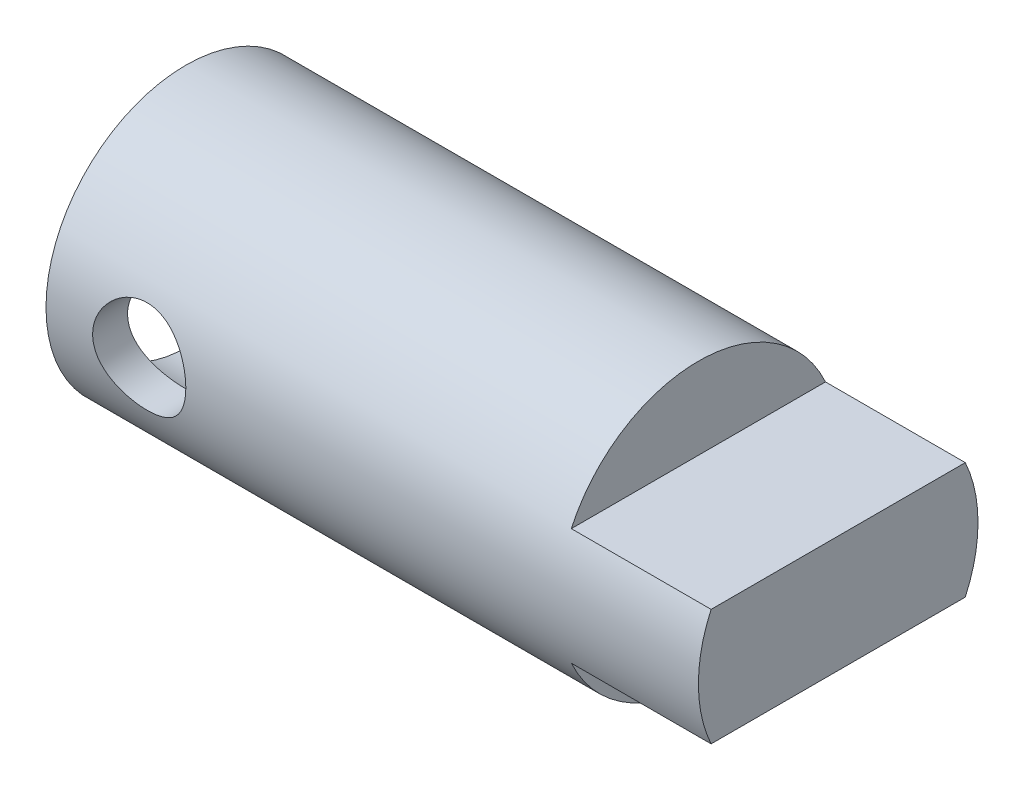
ISO-10303-21;
HEADER;
FILE_DESCRIPTION(('STEP AP214'),'2;1');
FILE_NAME('part.step','',(''),(''),'','','');
FILE_SCHEMA(('AUTOMOTIVE_DESIGN { 1 0 10303 214 1 1 1 1 }'));
ENDSEC;
DATA;
#1=APPLICATION_CONTEXT('core data for automotive mechanical design processes');
#2=APPLICATION_PROTOCOL_DEFINITION('international standard','automotive_design',2000,#1);
#3=PRODUCT_CONTEXT('',#1,'mechanical');
#4=PRODUCT('Part','Part','',(#3));
#5=PRODUCT_RELATED_PRODUCT_CATEGORY('part','',(#4));
#6=PRODUCT_DEFINITION_FORMATION('','',#4);
#7=PRODUCT_DEFINITION_CONTEXT('part definition',#1,'design');
#8=PRODUCT_DEFINITION('design','',#6,#7);
#9=PRODUCT_DEFINITION_SHAPE('','',#8);
#10=(LENGTH_UNIT() NAMED_UNIT(*) SI_UNIT(.MILLI.,.METRE.));
#11=(NAMED_UNIT(*) PLANE_ANGLE_UNIT() SI_UNIT($,.RADIAN.));
#12=(NAMED_UNIT(*) SI_UNIT($,.STERADIAN.) SOLID_ANGLE_UNIT());
#13=UNCERTAINTY_MEASURE_WITH_UNIT(LENGTH_MEASURE(1.E-05),#10,'distance_accuracy_value','');
#14=(GEOMETRIC_REPRESENTATION_CONTEXT(3) GLOBAL_UNCERTAINTY_ASSIGNED_CONTEXT((#13)) GLOBAL_UNIT_ASSIGNED_CONTEXT((#10,
#11,#12)) REPRESENTATION_CONTEXT('',''));
#15=CARTESIAN_POINT('',(0.,0.,0.));
#16=DIRECTION('',(0.,0.,1.));
#17=DIRECTION('',(1.,0.,0.));
#18=AXIS2_PLACEMENT_3D('',#15,#16,#17);
#19=CARTESIAN_POINT('',(0.,0.,0.));
#20=DIRECTION('',(-1.,0.,0.));
#21=DIRECTION('',(0.,0.,1.));
#22=AXIS2_PLACEMENT_3D('',#19,#20,#21);
#23=CONICAL_SURFACE('',#22,4.5,1.22689824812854);
#24=CARTESIAN_POINT('',(1.6115796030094,0.,0.));
#25=VERTEX_POINT('',#24);
#26=VERTEX_LOOP('',#25);
#27=FACE_BOUND('',#26,.T.);
#28=CARTESIAN_POINT('',(0.,0.,0.));
#29=DIRECTION('',(-1.,0.,0.));
#30=DIRECTION('',(0.,0.,1.));
#31=AXIS2_PLACEMENT_3D('',#28,#29,#30);
#32=CIRCLE('',#31,4.5);
#33=CARTESIAN_POINT('',(0.,0.,4.5));
#34=VERTEX_POINT('',#33);
#35=EDGE_CURVE('E112',#34,#34,#32,.T.);
#36=ORIENTED_EDGE('',*,*,#35,.T.);
#37=EDGE_LOOP('',(#36));
#38=FACE_BOUND('',#37,.T.);
#39=ADVANCED_FACE('F33',(#27,#38),#23,.F.);
#40=CARTESIAN_POINT('',(-58.2554655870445,0.,0.));
#41=DIRECTION('',(-1.,0.,0.));
#42=DIRECTION('',(0.,0.,1.));
#43=AXIS2_PLACEMENT_3D('',#40,#41,#42);
#44=CYLINDRICAL_SURFACE('',#43,4.5);
#45=CARTESIAN_POINT('',(-7.99999999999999,0.,4.5));
#46=CARTESIAN_POINT('',(-8.00000498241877,0.106491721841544,4.49999592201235));
#47=CARTESIAN_POINT('',(-8.0085554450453,0.21314990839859,4.49617759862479));
#48=CARTESIAN_POINT('',(-8.04241844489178,0.423397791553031,4.48128347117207));
#49=CARTESIAN_POINT('',(-8.06777125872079,0.526979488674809,4.4701902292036));
#50=CARTESIAN_POINT('',(-8.13410046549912,0.727700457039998,4.44192390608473));
#51=CARTESIAN_POINT('',(-8.17502111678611,0.824861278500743,4.4247725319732));
#52=CARTESIAN_POINT('',(-8.27107528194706,1.01083182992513,4.38602940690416));
#53=CARTESIAN_POINT('',(-8.32620555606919,1.09964345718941,4.36443866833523));
#54=CARTESIAN_POINT('',(-8.45233484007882,1.27147987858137,4.31759990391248));
#55=CARTESIAN_POINT('',(-8.52399764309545,1.35398160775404,4.29222181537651));
#56=CARTESIAN_POINT('',(-8.67974826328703,1.50625667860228,4.24118529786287));
#57=CARTESIAN_POINT('',(-8.76384343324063,1.57602243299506,4.21552671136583));
#58=CARTESIAN_POINT('',(-8.94793872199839,1.70484606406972,4.16516047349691));
#59=CARTESIAN_POINT('',(-9.04857681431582,1.76305311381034,4.14059326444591));
#60=CARTESIAN_POINT('',(-9.25945524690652,1.86148058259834,4.09729211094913));
#61=CARTESIAN_POINT('',(-9.3696899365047,1.90171150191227,4.07855476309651));
#62=CARTESIAN_POINT('',(-9.59062038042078,1.96081152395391,4.05046224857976));
#63=CARTESIAN_POINT('',(-9.70098673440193,1.98069316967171,4.04066532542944));
#64=CARTESIAN_POINT('',(-9.92388977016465,2.00167828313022,4.03031463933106));
#65=CARTESIAN_POINT('',(-10.0364249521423,2.00279429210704,4.02975470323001));
#66=CARTESIAN_POINT('',(-10.2496954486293,1.98697164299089,4.03757276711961));
#67=CARTESIAN_POINT('',(-10.3505853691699,1.97164003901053,4.04515525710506));
#68=CARTESIAN_POINT('',(-10.5481752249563,1.92608101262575,4.06704362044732));
#69=CARTESIAN_POINT('',(-10.6448742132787,1.89585024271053,4.08135100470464));
#70=CARTESIAN_POINT('',(-10.8339336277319,1.82075207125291,4.11540857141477));
#71=CARTESIAN_POINT('',(-10.9261479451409,1.77557135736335,4.13527371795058));
#72=CARTESIAN_POINT('',(-11.1020759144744,1.67208117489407,4.1781907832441));
#73=CARTESIAN_POINT('',(-11.1857859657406,1.61376617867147,4.20124404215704));
#74=CARTESIAN_POINT('',(-11.3509136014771,1.47900808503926,4.25066638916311));
#75=CARTESIAN_POINT('',(-11.4313134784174,1.40135242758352,4.2771397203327));
#76=CARTESIAN_POINT('',(-11.5783174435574,1.23343821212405,4.32854899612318));
#77=CARTESIAN_POINT('',(-11.6449173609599,1.14317585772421,4.3534844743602));
#78=CARTESIAN_POINT('',(-11.764213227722,0.949152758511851,4.39992448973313));
#79=CARTESIAN_POINT('',(-11.8164403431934,0.845072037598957,4.42130591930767));
#80=CARTESIAN_POINT('',(-11.9022769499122,0.628407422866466,4.45725580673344));
#81=CARTESIAN_POINT('',(-11.935898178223,0.515828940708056,4.47182855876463));
#82=CARTESIAN_POINT('',(-11.981311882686,0.293820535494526,4.4916825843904));
#83=CARTESIAN_POINT('',(-11.994466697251,0.184721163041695,4.49754246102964));
#84=CARTESIAN_POINT('',(-12.0027031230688,-0.0342770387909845,4.5012000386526));
#85=CARTESIAN_POINT('',(-11.997790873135,-0.144175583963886,4.49900047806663));
#86=CARTESIAN_POINT('',(-11.9709564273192,-0.354907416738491,4.48715295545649));
#87=CARTESIAN_POINT('',(-11.9500391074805,-0.455896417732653,4.47794517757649));
#88=CARTESIAN_POINT('',(-11.8932420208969,-0.652792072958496,4.45350542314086));
#89=CARTESIAN_POINT('',(-11.8573604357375,-0.748698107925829,4.43827271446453));
#90=CARTESIAN_POINT('',(-11.7705111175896,-0.936104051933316,4.40262377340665));
#91=CARTESIAN_POINT('',(-11.7191076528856,-1.02737315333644,4.38206065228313));
#92=CARTESIAN_POINT('',(-11.6031485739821,-1.20031927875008,4.33788123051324));
#93=CARTESIAN_POINT('',(-11.5385872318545,-1.28199210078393,4.31426360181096));
#94=CARTESIAN_POINT('',(-11.3920832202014,-1.44036721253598,4.26412793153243));
#95=CARTESIAN_POINT('',(-11.3091590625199,-1.5161383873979,4.23752954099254));
#96=CARTESIAN_POINT('',(-11.1314446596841,-1.65300242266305,4.18604134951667));
#97=CARTESIAN_POINT('',(-11.0366502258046,-1.71409007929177,4.16115215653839));
#98=CARTESIAN_POINT('',(-10.8348756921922,-1.8210757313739,4.11547790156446));
#99=CARTESIAN_POINT('',(-10.7276616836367,-1.86658327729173,4.09480296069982));
#100=CARTESIAN_POINT('',(-10.5058731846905,-1.9384649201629,4.06127502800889));
#101=CARTESIAN_POINT('',(-10.3913060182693,-1.96485774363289,4.04841438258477));
#102=CARTESIAN_POINT('',(-10.1685184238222,-1.99578547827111,4.03325053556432));
#103=CARTESIAN_POINT('',(-10.0605831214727,-2.00198344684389,4.03014488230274));
#104=CARTESIAN_POINT('',(-9.84524039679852,-1.99690774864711,4.03266289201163));
#105=CARTESIAN_POINT('',(-9.73783286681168,-1.9856378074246,4.03828469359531));
#106=CARTESIAN_POINT('',(-9.53330807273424,-1.94740226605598,4.056849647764));
#107=CARTESIAN_POINT('',(-9.43596048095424,-1.92142172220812,4.06933199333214));
#108=CARTESIAN_POINT('',(-9.24701808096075,-1.85554194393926,4.09978946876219));
#109=CARTESIAN_POINT('',(-9.15542494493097,-1.81563868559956,4.11776618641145));
#110=CARTESIAN_POINT('',(-8.97416239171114,-1.72012109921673,4.15861055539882));
#111=CARTESIAN_POINT('',(-8.88499235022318,-1.66366385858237,4.18171780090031));
#112=CARTESIAN_POINT('',(-8.71687518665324,-1.53773594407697,4.22964589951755));
#113=CARTESIAN_POINT('',(-8.63793235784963,-1.46825983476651,4.25446746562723));
#114=CARTESIAN_POINT('',(-8.4853775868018,-1.31108140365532,4.30563232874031));
#115=CARTESIAN_POINT('',(-8.41283603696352,-1.22231636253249,4.33191880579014));
#116=CARTESIAN_POINT('',(-8.28356478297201,-1.03295134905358,4.38093190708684));
#117=CARTESIAN_POINT('',(-8.22684230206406,-0.932345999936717,4.40365690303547));
#118=CARTESIAN_POINT('',(-8.13177613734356,-0.723051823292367,4.44279207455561));
#119=CARTESIAN_POINT('',(-8.09323188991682,-0.614467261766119,4.45927074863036));
#120=CARTESIAN_POINT('',(-8.03536024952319,-0.391615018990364,4.48431907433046));
#121=CARTESIAN_POINT('',(-8.01597423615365,-0.27736580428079,4.49291284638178));
#122=CARTESIAN_POINT('',(-8.0044002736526,-0.135356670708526,4.49804618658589));
#123=CARTESIAN_POINT('',(-8.00275171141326,-0.108319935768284,4.49877760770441));
#124=CARTESIAN_POINT('',(-8.00055093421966,-0.0541923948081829,4.49975503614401));
#125=CARTESIAN_POINT('',(-7.99999873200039,-0.0271015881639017,4.5000010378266));
#126=CARTESIAN_POINT('',(-7.99999999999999,0.,4.5));
#127=B_SPLINE_CURVE_WITH_KNOTS('',3,(#45,#46,#47,#48,#49,#50,#51,#52,#53,#54,#55,#56,#57,#58,
#59,#60,#61,#62,#63,#64,#65,#66,#67,#68,#69,#70,#71,#72,#73,#74,#75,#76,#77,#78,#79,#80,#81,#82,
#83,#84,#85,#86,#87,#88,#89,#90,#91,#92,#93,#94,#95,#96,#97,#98,#99,#100,#101,#102,#103,#104,
#105,#106,#107,#108,#109,#110,#111,#112,#113,#114,#115,#116,#117,#118,#119,#120,#121,#122,#123,
#124,#125,#126),.UNSPECIFIED.,.T.,.F.,(4,2,2,2,2,2,2,2,2,2,2,2,2,2,2,2,2,2,2,2,2,2,2,2,2,2,2,2,
2,2,2,2,2,2,2,2,2,2,2,2,4),(0.,0.319363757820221,0.639495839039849,0.958492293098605,
1.27741608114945,1.61253910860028,1.9478611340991,2.30254396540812,2.65701934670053,
2.99284475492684,3.32844571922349,3.63400850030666,3.93963996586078,4.25213185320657,
4.56475550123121,4.90783346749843,5.25101497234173,5.6043339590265,5.95742980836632,
6.28582812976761,6.61411487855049,6.92332786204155,7.23257843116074,7.5514769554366,
7.87051460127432,8.2152651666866,8.56013773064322,8.91311015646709,9.26573630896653,
9.58847399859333,9.91114286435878,10.214399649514,10.5177441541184,10.8405269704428,
11.1634448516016,11.5146101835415,11.8659356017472,12.2132884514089,12.5595751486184,
12.6408506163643,12.7221270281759),.UNSPECIFIED.);
#128=CARTESIAN_POINT('',(-7.99999999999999,0.,4.5));
#129=VERTEX_POINT('',#128);
#130=EDGE_CURVE('E88',#129,#129,#127,.T.);
#131=ORIENTED_EDGE('',*,*,#130,.T.);
#132=EDGE_LOOP('',(#131));
#133=FACE_BOUND('',#132,.T.);
#134=CARTESIAN_POINT('',(-8.,0.,-4.5));
#135=CARTESIAN_POINT('',(-8.00000498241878,-0.106491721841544,-4.49999592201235));
#136=CARTESIAN_POINT('',(-8.0085554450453,-0.213149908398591,-4.49617759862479));
#137=CARTESIAN_POINT('',(-8.04241844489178,-0.423397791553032,-4.48128347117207));
#138=CARTESIAN_POINT('',(-8.06777125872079,-0.52697948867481,-4.4701902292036));
#139=CARTESIAN_POINT('',(-8.13410046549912,-0.727700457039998,-4.44192390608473));
#140=CARTESIAN_POINT('',(-8.17502111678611,-0.824861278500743,-4.4247725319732));
#141=CARTESIAN_POINT('',(-8.27107528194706,-1.01083182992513,-4.38602940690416));
#142=CARTESIAN_POINT('',(-8.32620555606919,-1.09964345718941,-4.36443866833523));
#143=CARTESIAN_POINT('',(-8.45233484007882,-1.27147987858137,-4.31759990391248));
#144=CARTESIAN_POINT('',(-8.52399764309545,-1.35398160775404,-4.29222181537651));
#145=CARTESIAN_POINT('',(-8.67974826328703,-1.50625667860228,-4.24118529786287));
#146=CARTESIAN_POINT('',(-8.76384343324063,-1.57602243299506,-4.21552671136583));
#147=CARTESIAN_POINT('',(-8.94793872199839,-1.70484606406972,-4.16516047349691));
#148=CARTESIAN_POINT('',(-9.04857681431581,-1.76305311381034,-4.14059326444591));
#149=CARTESIAN_POINT('',(-9.25945524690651,-1.86148058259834,-4.09729211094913));
#150=CARTESIAN_POINT('',(-9.3696899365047,-1.90171150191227,-4.07855476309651));
#151=CARTESIAN_POINT('',(-9.59062038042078,-1.96081152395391,-4.05046224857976));
#152=CARTESIAN_POINT('',(-9.70098673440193,-1.98069316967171,-4.04066532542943));
#153=CARTESIAN_POINT('',(-9.92388977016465,-2.00167828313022,-4.03031463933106));
#154=CARTESIAN_POINT('',(-10.0364249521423,-2.00279429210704,-4.02975470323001));
#155=CARTESIAN_POINT('',(-10.2496954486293,-1.98697164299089,-4.03757276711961));
#156=CARTESIAN_POINT('',(-10.3505853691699,-1.97164003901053,-4.04515525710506));
#157=CARTESIAN_POINT('',(-10.5481752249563,-1.92608101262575,-4.06704362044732));
#158=CARTESIAN_POINT('',(-10.6448742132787,-1.89585024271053,-4.08135100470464));
#159=CARTESIAN_POINT('',(-10.8339336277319,-1.82075207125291,-4.11540857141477));
#160=CARTESIAN_POINT('',(-10.9261479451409,-1.77557135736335,-4.13527371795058));
#161=CARTESIAN_POINT('',(-11.1020759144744,-1.67208117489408,-4.1781907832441));
#162=CARTESIAN_POINT('',(-11.1857859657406,-1.61376617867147,-4.20124404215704));
#163=CARTESIAN_POINT('',(-11.3509136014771,-1.47900808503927,-4.25066638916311));
#164=CARTESIAN_POINT('',(-11.4313134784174,-1.40135242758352,-4.2771397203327));
#165=CARTESIAN_POINT('',(-11.5783174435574,-1.23343821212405,-4.32854899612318));
#166=CARTESIAN_POINT('',(-11.6449173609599,-1.14317585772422,-4.3534844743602));
#167=CARTESIAN_POINT('',(-11.764213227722,-0.949152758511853,-4.39992448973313));
#168=CARTESIAN_POINT('',(-11.8164403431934,-0.845072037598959,-4.42130591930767));
#169=CARTESIAN_POINT('',(-11.9022769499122,-0.628407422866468,-4.45725580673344));
#170=CARTESIAN_POINT('',(-11.935898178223,-0.515828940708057,-4.47182855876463));
#171=CARTESIAN_POINT('',(-11.981311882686,-0.293820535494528,-4.4916825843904));
#172=CARTESIAN_POINT('',(-11.994466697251,-0.184721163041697,-4.49754246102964));
#173=CARTESIAN_POINT('',(-12.0027031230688,0.0342770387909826,-4.5012000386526));
#174=CARTESIAN_POINT('',(-11.997790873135,0.144175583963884,-4.49900047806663));
#175=CARTESIAN_POINT('',(-11.9709564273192,0.354907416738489,-4.48715295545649));
#176=CARTESIAN_POINT('',(-11.9500391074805,0.45589641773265,-4.47794517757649));
#177=CARTESIAN_POINT('',(-11.8932420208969,0.652792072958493,-4.45350542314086));
#178=CARTESIAN_POINT('',(-11.8573604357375,0.748698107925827,-4.43827271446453));
#179=CARTESIAN_POINT('',(-11.7705111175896,0.936104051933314,-4.40262377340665));
#180=CARTESIAN_POINT('',(-11.7191076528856,1.02737315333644,-4.38206065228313));
#181=CARTESIAN_POINT('',(-11.6031485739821,1.20031927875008,-4.33788123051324));
#182=CARTESIAN_POINT('',(-11.5385872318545,1.28199210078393,-4.31426360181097));
#183=CARTESIAN_POINT('',(-11.3920832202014,1.44036721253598,-4.26412793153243));
#184=CARTESIAN_POINT('',(-11.3091590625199,1.5161383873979,-4.23752954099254));
#185=CARTESIAN_POINT('',(-11.1314446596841,1.65300242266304,-4.18604134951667));
#186=CARTESIAN_POINT('',(-11.0366502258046,1.71409007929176,-4.16115215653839));
#187=CARTESIAN_POINT('',(-10.8348756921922,1.8210757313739,-4.11547790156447));
#188=CARTESIAN_POINT('',(-10.7276616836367,1.86658327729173,-4.09480296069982));
#189=CARTESIAN_POINT('',(-10.5058731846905,1.9384649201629,-4.06127502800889));
#190=CARTESIAN_POINT('',(-10.3913060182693,1.96485774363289,-4.04841438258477));
#191=CARTESIAN_POINT('',(-10.1685184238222,1.9957854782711,-4.03325053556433));
#192=CARTESIAN_POINT('',(-10.0605831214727,2.00198344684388,-4.03014488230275));
#193=CARTESIAN_POINT('',(-9.84524039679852,1.99690774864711,-4.03266289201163));
#194=CARTESIAN_POINT('',(-9.73783286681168,1.9856378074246,-4.03828469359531));
#195=CARTESIAN_POINT('',(-9.53330807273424,1.94740226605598,-4.056849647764));
#196=CARTESIAN_POINT('',(-9.43596048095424,1.92142172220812,-4.06933199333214));
#197=CARTESIAN_POINT('',(-9.24701808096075,1.85554194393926,-4.09978946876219));
#198=CARTESIAN_POINT('',(-9.15542494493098,1.81563868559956,-4.11776618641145));
#199=CARTESIAN_POINT('',(-8.97416239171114,1.72012109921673,-4.15861055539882));
#200=CARTESIAN_POINT('',(-8.88499235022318,1.66366385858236,-4.18171780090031));
#201=CARTESIAN_POINT('',(-8.71687518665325,1.53773594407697,-4.22964589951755));
#202=CARTESIAN_POINT('',(-8.63793235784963,1.4682598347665,-4.25446746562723));
#203=CARTESIAN_POINT('',(-8.4853775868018,1.31108140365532,-4.30563232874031));
#204=CARTESIAN_POINT('',(-8.41283603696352,1.22231636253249,-4.33191880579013));
#205=CARTESIAN_POINT('',(-8.28356478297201,1.03295134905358,-4.38093190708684));
#206=CARTESIAN_POINT('',(-8.22684230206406,0.932345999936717,-4.40365690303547));
#207=CARTESIAN_POINT('',(-8.13177613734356,0.723051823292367,-4.44279207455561));
#208=CARTESIAN_POINT('',(-8.09323188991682,0.614467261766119,-4.45927074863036));
#209=CARTESIAN_POINT('',(-8.03536024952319,0.391615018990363,-4.48431907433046));
#210=CARTESIAN_POINT('',(-8.01597423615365,0.277365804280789,-4.49291284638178));
#211=CARTESIAN_POINT('',(-8.0044002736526,0.135356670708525,-4.49804618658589));
#212=CARTESIAN_POINT('',(-8.00275171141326,0.108319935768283,-4.49877760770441));
#213=CARTESIAN_POINT('',(-8.00055093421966,0.0541923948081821,-4.49975503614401));
#214=CARTESIAN_POINT('',(-7.99999873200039,0.0271015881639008,-4.5000010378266));
#215=CARTESIAN_POINT('',(-8.,0.,-4.5));
#216=B_SPLINE_CURVE_WITH_KNOTS('',3,(#134,#135,#136,#137,#138,#139,#140,#141,#142,#143,#144,
#145,#146,#147,#148,#149,#150,#151,#152,#153,#154,#155,#156,#157,#158,#159,#160,#161,#162,#163,
#164,#165,#166,#167,#168,#169,#170,#171,#172,#173,#174,#175,#176,#177,#178,#179,#180,#181,#182,
#183,#184,#185,#186,#187,#188,#189,#190,#191,#192,#193,#194,#195,#196,#197,#198,#199,#200,#201,
#202,#203,#204,#205,#206,#207,#208,#209,#210,#211,#212,#213,#214,#215),.UNSPECIFIED.,.T.,.F.,(4,
2,2,2,2,2,2,2,2,2,2,2,2,2,2,2,2,2,2,2,2,2,2,2,2,2,2,2,2,2,2,2,2,2,2,2,2,2,2,2,4),(0.,
0.319363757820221,0.639495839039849,0.958492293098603,1.27741608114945,1.61253910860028,
1.9478611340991,2.30254396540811,2.65701934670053,2.99284475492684,3.32844571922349,
3.63400850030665,3.93963996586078,4.25213185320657,4.56475550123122,4.90783346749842,
5.25101497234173,5.6043339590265,5.95742980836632,6.28582812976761,6.61411487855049,
6.92332786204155,7.23257843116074,7.5514769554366,7.87051460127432,8.2152651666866,
8.56013773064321,8.91311015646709,9.26573630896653,9.58847399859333,9.91114286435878,
10.214399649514,10.5177441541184,10.8405269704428,11.1634448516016,11.5146101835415,
11.8659356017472,12.2132884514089,12.5595751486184,12.6408506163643,12.7221270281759),.UNSPECIFIED.);
#217=CARTESIAN_POINT('',(-8.,0.,-4.5));
#218=VERTEX_POINT('',#217);
#219=EDGE_CURVE('E140',#218,#218,#216,.T.);
#220=ORIENTED_EDGE('',*,*,#219,.T.);
#221=EDGE_LOOP('',(#220));
#222=FACE_BOUND('',#221,.T.);
#223=ORIENTED_EDGE('',*,*,#35,.F.);
#224=EDGE_LOOP('',(#223));
#225=FACE_BOUND('',#224,.T.);
#226=CARTESIAN_POINT('',(-14.,0.,0.));
#227=DIRECTION('',(-1.,0.,0.));
#228=DIRECTION('',(0.,0.,1.));
#229=AXIS2_PLACEMENT_3D('',#226,#227,#228);
#230=CIRCLE('',#229,4.5);
#231=CARTESIAN_POINT('',(-14.,0.,4.5));
#232=VERTEX_POINT('',#231);
#233=EDGE_CURVE('E109',#232,#232,#230,.T.);
#234=ORIENTED_EDGE('',*,*,#233,.T.);
#235=EDGE_LOOP('',(#234));
#236=FACE_BOUND('',#235,.T.);
#237=ADVANCED_FACE('F146',(#133,#222,#225,#236),#44,.F.);
#238=CARTESIAN_POINT('',(-14.,4.5,0.));
#239=DIRECTION('',(1.,0.,0.));
#240=DIRECTION('',(0.,0.,-1.));
#241=AXIS2_PLACEMENT_3D('',#238,#239,#240);
#242=PLANE('',#241);
#243=ORIENTED_EDGE('',*,*,#233,.F.);
#244=EDGE_LOOP('',(#243));
#245=FACE_BOUND('',#244,.T.);
#246=CARTESIAN_POINT('',(-14.,0.,0.));
#247=DIRECTION('',(-1.,0.,0.));
#248=DIRECTION('',(0.,0.,1.));
#249=AXIS2_PLACEMENT_3D('',#246,#247,#248);
#250=CIRCLE('',#249,6.);
#251=CARTESIAN_POINT('',(-14.,0.,6.));
#252=VERTEX_POINT('',#251);
#253=EDGE_CURVE('E106',#252,#252,#250,.T.);
#254=ORIENTED_EDGE('',*,*,#253,.T.);
#255=EDGE_LOOP('',(#254));
#256=FACE_BOUND('',#255,.T.);
#257=ADVANCED_FACE('F149',(#245,#256),#242,.F.);
#258=CARTESIAN_POINT('',(-58.2554655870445,0.,0.));
#259=DIRECTION('',(-1.,0.,0.));
#260=DIRECTION('',(0.,0.,1.));
#261=AXIS2_PLACEMENT_3D('',#258,#259,#260);
#262=CYLINDRICAL_SURFACE('',#261,6.);
#263=CARTESIAN_POINT('',(-7.99999999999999,0.,6.));
#264=CARTESIAN_POINT('',(-7.99999949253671,-0.109126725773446,6.00000030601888));
#265=CARTESIAN_POINT('',(-8.00896053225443,-0.2182503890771,5.9969953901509));
#266=CARTESIAN_POINT('',(-8.04445821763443,-0.433283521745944,5.98530420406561));
#267=CARTESIAN_POINT('',(-8.07099668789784,-0.539192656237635,5.97661734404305));
#268=CARTESIAN_POINT('',(-8.14063848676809,-0.744665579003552,5.95450615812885));
#269=CARTESIAN_POINT('',(-8.18371412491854,-0.844239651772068,5.94108975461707));
#270=CARTESIAN_POINT('',(-8.28508234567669,-1.03474987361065,5.91088891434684));
#271=CARTESIAN_POINT('',(-8.3433779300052,-1.12568431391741,5.89410381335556));
#272=CARTESIAN_POINT('',(-8.4756516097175,-1.29948335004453,5.8582818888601));
#273=CARTESIAN_POINT('',(-8.55006246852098,-1.38200740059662,5.8391911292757));
#274=CARTESIAN_POINT('',(-8.71153430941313,-1.53366538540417,5.80120629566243));
#275=CARTESIAN_POINT('',(-8.79859806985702,-1.60279637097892,5.78231226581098));
#276=CARTESIAN_POINT('',(-8.98597023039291,-1.72764988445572,5.74626664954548));
#277=CARTESIAN_POINT('',(-9.08658747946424,-1.78292971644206,5.72918078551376));
#278=CARTESIAN_POINT('',(-9.29635218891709,-1.87563774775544,5.69950610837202));
#279=CARTESIAN_POINT('',(-9.40549703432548,-1.91307139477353,5.68691592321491));
#280=CARTESIAN_POINT('',(-9.62534644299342,-1.96774692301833,5.66822606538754));
#281=CARTESIAN_POINT('',(-9.73587441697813,-1.98562689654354,5.66192191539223));
#282=CARTESIAN_POINT('',(-9.95852750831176,-2.00268224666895,5.65591313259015));
#283=CARTESIAN_POINT('',(-10.0706521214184,-2.00186340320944,5.6562064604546));
#284=CARTESIAN_POINT('',(-10.287873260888,-1.98203980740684,5.6631803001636));
#285=CARTESIAN_POINT('',(-10.393056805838,-1.96386782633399,5.66956831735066));
#286=CARTESIAN_POINT('',(-10.5987868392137,-1.91121232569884,5.68753315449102));
#287=CARTESIAN_POINT('',(-10.6993327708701,-1.87672685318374,5.69911059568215));
#288=CARTESIAN_POINT('',(-10.894825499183,-1.79187811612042,5.72635822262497));
#289=CARTESIAN_POINT('',(-10.989656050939,-1.74126809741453,5.74209131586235));
#290=CARTESIAN_POINT('',(-11.1697418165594,-1.62577821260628,5.77585117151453));
#291=CARTESIAN_POINT('',(-11.2549942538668,-1.56089422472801,5.79387859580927));
#292=CARTESIAN_POINT('',(-11.4181831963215,-1.41469866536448,5.83134658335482));
#293=CARTESIAN_POINT('',(-11.4955053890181,-1.33270630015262,5.85081178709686));
#294=CARTESIAN_POINT('',(-11.6354625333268,-1.15667913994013,5.88813876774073));
#295=CARTESIAN_POINT('',(-11.698096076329,-1.06264319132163,5.90600039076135));
#296=CARTESIAN_POINT('',(-11.8073926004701,-0.863895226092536,5.93834215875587));
#297=CARTESIAN_POINT('',(-11.8538909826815,-0.759086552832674,5.95278700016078));
#298=CARTESIAN_POINT('',(-11.9284063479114,-0.542538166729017,5.9764113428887));
#299=CARTESIAN_POINT('',(-11.9564297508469,-0.430800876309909,5.98559267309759));
#300=CARTESIAN_POINT('',(-11.9921113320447,-0.20876765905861,5.99735254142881));
#301=CARTESIAN_POINT('',(-12.0005996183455,-0.0986191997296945,6.00020003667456));
#302=CARTESIAN_POINT('',(-11.9993346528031,0.121550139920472,5.99977805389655));
#303=CARTESIAN_POINT('',(-11.9895844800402,0.231571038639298,5.99650960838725));
#304=CARTESIAN_POINT('',(-11.9527761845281,0.445039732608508,5.98440049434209));
#305=CARTESIAN_POINT('',(-11.926227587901,0.548585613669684,5.97572397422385));
#306=CARTESIAN_POINT('',(-11.8572131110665,0.749711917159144,5.9538369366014));
#307=CARTESIAN_POINT('',(-11.8147452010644,0.84729157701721,5.9406258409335));
#308=CARTESIAN_POINT('',(-11.7138591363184,1.03657659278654,5.9105786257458));
#309=CARTESIAN_POINT('',(-11.6550508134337,1.12805991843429,5.89365629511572));
#310=CARTESIAN_POINT('',(-11.523611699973,1.30012966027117,5.85810507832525));
#311=CARTESIAN_POINT('',(-11.4509766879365,1.38071273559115,5.83947567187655));
#312=CARTESIAN_POINT('',(-11.2900424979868,1.5325050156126,5.8015369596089));
#313=CARTESIAN_POINT('',(-11.2011815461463,1.60312193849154,5.78223522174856));
#314=CARTESIAN_POINT('',(-11.0124568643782,1.72851504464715,5.74599946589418));
#315=CARTESIAN_POINT('',(-10.9125930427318,1.78329109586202,5.72906546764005));
#316=CARTESIAN_POINT('',(-10.7046539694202,1.87519386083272,5.69964783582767));
#317=CARTESIAN_POINT('',(-10.5965958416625,1.91235626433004,5.68715521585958));
#318=CARTESIAN_POINT('',(-10.3752426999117,1.96778933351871,5.66821664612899));
#319=CARTESIAN_POINT('',(-10.2619500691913,1.98606850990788,5.66176797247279));
#320=CARTESIAN_POINT('',(-10.0396058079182,2.00255256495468,5.65595717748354));
#321=CARTESIAN_POINT('',(-9.93063531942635,2.0017405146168,5.6562480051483));
#322=CARTESIAN_POINT('',(-9.71446985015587,1.98248458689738,5.66302539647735));
#323=CARTESIAN_POINT('',(-9.60727476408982,1.96404175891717,5.66951159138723));
#324=CARTESIAN_POINT('',(-9.39972867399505,1.91074362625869,5.68769048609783));
#325=CARTESIAN_POINT('',(-9.29928634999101,1.87620669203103,5.69928196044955));
#326=CARTESIAN_POINT('',(-9.10554518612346,1.79195873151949,5.72632797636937));
#327=CARTESIAN_POINT('',(-9.01224793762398,1.74224433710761,5.74178337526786));
#328=CARTESIAN_POINT('',(-8.83103266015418,1.62652138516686,5.77565658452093));
#329=CARTESIAN_POINT('',(-8.74352699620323,1.55989648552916,5.79417423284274));
#330=CARTESIAN_POINT('',(-8.5806203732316,1.4132857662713,5.83166712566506));
#331=CARTESIAN_POINT('',(-8.50522284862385,1.33329616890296,5.85064249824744));
#332=CARTESIAN_POINT('',(-8.36571117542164,1.15848311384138,5.88780061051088));
#333=CARTESIAN_POINT('',(-8.302151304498,1.06320302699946,5.90592363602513));
#334=CARTESIAN_POINT('',(-8.1920191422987,0.862714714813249,5.93851982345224));
#335=CARTESIAN_POINT('',(-8.14544250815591,0.757509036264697,5.9529939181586));
#336=CARTESIAN_POINT('',(-8.07255673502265,0.544987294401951,5.97611030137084));
#337=CARTESIAN_POINT('',(-8.04543506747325,0.437975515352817,5.98498424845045));
#338=CARTESIAN_POINT('',(-8.00915943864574,0.220640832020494,5.99692814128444));
#339=CARTESIAN_POINT('',(-8.00000051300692,0.110318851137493,5.9999996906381));
#340=CARTESIAN_POINT('',(-7.99999999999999,0.,6.));
#341=B_SPLINE_CURVE_WITH_KNOTS('',3,(#263,#264,#265,#266,#267,#268,#269,#270,#271,#272,#273,
#274,#275,#276,#277,#278,#279,#280,#281,#282,#283,#284,#285,#286,#287,#288,#289,#290,#291,#292,
#293,#294,#295,#296,#297,#298,#299,#300,#301,#302,#303,#304,#305,#306,#307,#308,#309,#310,#311,
#312,#313,#314,#315,#316,#317,#318,#319,#320,#321,#322,#323,#324,#325,#326,#327,#328,#329,#330,
#331,#332,#333,#334,#335,#336,#337,#338,#339,#340),.UNSPECIFIED.,.T.,.F.,(4,2,2,2,2,2,2,2,2,2,2,
2,2,2,2,2,2,2,2,2,2,2,2,2,2,2,2,2,2,2,2,2,2,2,2,2,2,2,4),(0.,0.326974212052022,
0.653982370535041,0.980445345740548,1.3069727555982,1.64369368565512,1.9804886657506,
2.32696769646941,2.67334089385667,3.0080385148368,3.34263267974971,3.6619365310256,
3.98127861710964,4.30576342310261,4.63034205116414,4.97186611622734,5.31342291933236,
5.65836811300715,6.00319337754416,6.33307166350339,6.66289426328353,6.98316315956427,
7.30347290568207,7.63220799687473,7.96104361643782,8.30482045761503,8.64860016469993,
8.9916802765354,9.3346056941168,9.65991332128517,9.9852015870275,10.3043117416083,
10.6234927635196,10.9566013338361,11.2898042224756,11.635993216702,11.9820936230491,
12.3127311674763,12.6432773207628),.UNSPECIFIED.);
#342=CARTESIAN_POINT('',(-7.99999999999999,0.,6.));
#343=VERTEX_POINT('',#342);
#344=EDGE_CURVE('E36',#343,#343,#341,.T.);
#345=ORIENTED_EDGE('',*,*,#344,.T.);
#346=EDGE_LOOP('',(#345));
#347=FACE_BOUND('',#346,.T.);
#348=CARTESIAN_POINT('',(-8.,0.,-6.));
#349=CARTESIAN_POINT('',(-7.99999949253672,0.109126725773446,-6.00000030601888));
#350=CARTESIAN_POINT('',(-8.00896053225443,0.218250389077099,-5.9969953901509));
#351=CARTESIAN_POINT('',(-8.04445821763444,0.433283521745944,-5.98530420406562));
#352=CARTESIAN_POINT('',(-8.07099668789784,0.539192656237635,-5.97661734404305));
#353=CARTESIAN_POINT('',(-8.1406384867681,0.744665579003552,-5.95450615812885));
#354=CARTESIAN_POINT('',(-8.18371412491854,0.844239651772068,-5.94108975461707));
#355=CARTESIAN_POINT('',(-8.28508234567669,1.03474987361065,-5.91088891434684));
#356=CARTESIAN_POINT('',(-8.3433779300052,1.12568431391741,-5.89410381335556));
#357=CARTESIAN_POINT('',(-8.4756516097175,1.29948335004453,-5.8582818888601));
#358=CARTESIAN_POINT('',(-8.55006246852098,1.38200740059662,-5.8391911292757));
#359=CARTESIAN_POINT('',(-8.71153430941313,1.53366538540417,-5.80120629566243));
#360=CARTESIAN_POINT('',(-8.79859806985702,1.60279637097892,-5.78231226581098));
#361=CARTESIAN_POINT('',(-8.98597023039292,1.72764988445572,-5.74626664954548));
#362=CARTESIAN_POINT('',(-9.08658747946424,1.78292971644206,-5.72918078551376));
#363=CARTESIAN_POINT('',(-9.29635218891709,1.87563774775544,-5.69950610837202));
#364=CARTESIAN_POINT('',(-9.40549703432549,1.91307139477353,-5.68691592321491));
#365=CARTESIAN_POINT('',(-9.62534644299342,1.96774692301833,-5.66822606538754));
#366=CARTESIAN_POINT('',(-9.73587441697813,1.98562689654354,-5.66192191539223));
#367=CARTESIAN_POINT('',(-9.95852750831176,2.00268224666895,-5.65591313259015));
#368=CARTESIAN_POINT('',(-10.0706521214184,2.00186340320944,-5.6562064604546));
#369=CARTESIAN_POINT('',(-10.287873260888,1.98203980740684,-5.6631803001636));
#370=CARTESIAN_POINT('',(-10.393056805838,1.96386782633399,-5.66956831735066));
#371=CARTESIAN_POINT('',(-10.5987868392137,1.91121232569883,-5.68753315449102));
#372=CARTESIAN_POINT('',(-10.6993327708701,1.87672685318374,-5.69911059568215));
#373=CARTESIAN_POINT('',(-10.894825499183,1.79187811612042,-5.72635822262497));
#374=CARTESIAN_POINT('',(-10.989656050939,1.74126809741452,-5.74209131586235));
#375=CARTESIAN_POINT('',(-11.1697418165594,1.62577821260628,-5.77585117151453));
#376=CARTESIAN_POINT('',(-11.2549942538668,1.56089422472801,-5.79387859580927));
#377=CARTESIAN_POINT('',(-11.4181831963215,1.41469866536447,-5.83134658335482));
#378=CARTESIAN_POINT('',(-11.4955053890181,1.33270630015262,-5.85081178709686));
#379=CARTESIAN_POINT('',(-11.6354625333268,1.15667913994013,-5.88813876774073));
#380=CARTESIAN_POINT('',(-11.698096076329,1.06264319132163,-5.90600039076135));
#381=CARTESIAN_POINT('',(-11.8073926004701,0.863895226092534,-5.93834215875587));
#382=CARTESIAN_POINT('',(-11.8538909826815,0.759086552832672,-5.95278700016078));
#383=CARTESIAN_POINT('',(-11.9284063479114,0.542538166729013,-5.9764113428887));
#384=CARTESIAN_POINT('',(-11.9564297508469,0.430800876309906,-5.98559267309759));
#385=CARTESIAN_POINT('',(-11.9921113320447,0.208767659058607,-5.99735254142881));
#386=CARTESIAN_POINT('',(-12.0005996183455,0.0986191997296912,-6.00020003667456));
#387=CARTESIAN_POINT('',(-11.9993346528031,-0.121550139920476,-5.99977805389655));
#388=CARTESIAN_POINT('',(-11.9895844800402,-0.231571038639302,-5.99650960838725));
#389=CARTESIAN_POINT('',(-11.9527761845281,-0.445039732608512,-5.98440049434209));
#390=CARTESIAN_POINT('',(-11.926227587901,-0.548585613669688,-5.97572397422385));
#391=CARTESIAN_POINT('',(-11.8572131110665,-0.749711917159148,-5.9538369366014));
#392=CARTESIAN_POINT('',(-11.8147452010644,-0.847291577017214,-5.9406258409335));
#393=CARTESIAN_POINT('',(-11.7138591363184,-1.03657659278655,-5.91057862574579));
#394=CARTESIAN_POINT('',(-11.6550508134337,-1.12805991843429,-5.89365629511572));
#395=CARTESIAN_POINT('',(-11.523611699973,-1.30012966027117,-5.85810507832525));
#396=CARTESIAN_POINT('',(-11.4509766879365,-1.38071273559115,-5.83947567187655));
#397=CARTESIAN_POINT('',(-11.2900424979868,-1.5325050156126,-5.80153695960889));
#398=CARTESIAN_POINT('',(-11.2011815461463,-1.60312193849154,-5.78223522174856));
#399=CARTESIAN_POINT('',(-11.0124568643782,-1.72851504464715,-5.74599946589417));
#400=CARTESIAN_POINT('',(-10.9125930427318,-1.78329109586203,-5.72906546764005));
#401=CARTESIAN_POINT('',(-10.7046539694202,-1.87519386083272,-5.69964783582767));
#402=CARTESIAN_POINT('',(-10.5965958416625,-1.91235626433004,-5.68715521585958));
#403=CARTESIAN_POINT('',(-10.3752426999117,-1.96778933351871,-5.66821664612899));
#404=CARTESIAN_POINT('',(-10.2619500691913,-1.98606850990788,-5.66176797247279));
#405=CARTESIAN_POINT('',(-10.0396058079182,-2.00255256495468,-5.65595717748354));
#406=CARTESIAN_POINT('',(-9.93063531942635,-2.0017405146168,-5.6562480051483));
#407=CARTESIAN_POINT('',(-9.71446985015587,-1.98248458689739,-5.66302539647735));
#408=CARTESIAN_POINT('',(-9.60727476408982,-1.96404175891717,-5.66951159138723));
#409=CARTESIAN_POINT('',(-9.39972867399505,-1.91074362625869,-5.68769048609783));
#410=CARTESIAN_POINT('',(-9.299286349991,-1.87620669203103,-5.69928196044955));
#411=CARTESIAN_POINT('',(-9.10554518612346,-1.79195873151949,-5.72632797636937));
#412=CARTESIAN_POINT('',(-9.01224793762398,-1.74224433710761,-5.74178337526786));
#413=CARTESIAN_POINT('',(-8.83103266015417,-1.62652138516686,-5.77565658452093));
#414=CARTESIAN_POINT('',(-8.74352699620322,-1.55989648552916,-5.79417423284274));
#415=CARTESIAN_POINT('',(-8.5806203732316,-1.4132857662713,-5.83166712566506));
#416=CARTESIAN_POINT('',(-8.50522284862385,-1.33329616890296,-5.85064249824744));
#417=CARTESIAN_POINT('',(-8.36571117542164,-1.15848311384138,-5.88780061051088));
#418=CARTESIAN_POINT('',(-8.302151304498,-1.06320302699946,-5.90592363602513));
#419=CARTESIAN_POINT('',(-8.1920191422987,-0.862714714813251,-5.93851982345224));
#420=CARTESIAN_POINT('',(-8.14544250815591,-0.757509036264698,-5.9529939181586));
#421=CARTESIAN_POINT('',(-8.07255673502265,-0.544987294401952,-5.97611030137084));
#422=CARTESIAN_POINT('',(-8.04543506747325,-0.437975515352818,-5.98498424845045));
#423=CARTESIAN_POINT('',(-8.00915943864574,-0.220640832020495,-5.99692814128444));
#424=CARTESIAN_POINT('',(-8.00000051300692,-0.110318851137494,-5.9999996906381));
#425=CARTESIAN_POINT('',(-8.,0.,-6.));
#426=B_SPLINE_CURVE_WITH_KNOTS('',3,(#348,#349,#350,#351,#352,#353,#354,#355,#356,#357,#358,
#359,#360,#361,#362,#363,#364,#365,#366,#367,#368,#369,#370,#371,#372,#373,#374,#375,#376,#377,
#378,#379,#380,#381,#382,#383,#384,#385,#386,#387,#388,#389,#390,#391,#392,#393,#394,#395,#396,
#397,#398,#399,#400,#401,#402,#403,#404,#405,#406,#407,#408,#409,#410,#411,#412,#413,#414,#415,
#416,#417,#418,#419,#420,#421,#422,#423,#424,#425),.UNSPECIFIED.,.T.,.F.,(4,2,2,2,2,2,2,2,2,2,2,
2,2,2,2,2,2,2,2,2,2,2,2,2,2,2,2,2,2,2,2,2,2,2,2,2,2,2,4),(0.,0.326974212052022,
0.653982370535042,0.980445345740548,1.3069727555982,1.64369368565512,1.9804886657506,
2.32696769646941,2.67334089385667,3.0080385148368,3.34263267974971,3.66193653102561,
3.98127861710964,4.30576342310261,4.63034205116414,4.97186611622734,5.31342291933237,
5.65836811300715,6.00319337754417,6.33307166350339,6.66289426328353,6.98316315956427,
7.30347290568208,7.63220799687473,7.96104361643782,8.30482045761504,8.64860016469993,
8.99168027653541,9.3346056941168,9.65991332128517,9.9852015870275,10.3043117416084,
10.6234927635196,10.9566013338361,11.2898042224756,11.635993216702,11.9820936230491,
12.3127311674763,12.6432773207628),.UNSPECIFIED.);
#427=CARTESIAN_POINT('',(-8.,0.,-6.));
#428=VERTEX_POINT('',#427);
#429=EDGE_CURVE('E121',#428,#428,#426,.T.);
#430=ORIENTED_EDGE('',*,*,#429,.T.);
#431=EDGE_LOOP('',(#430));
#432=FACE_BOUND('',#431,.T.);
#433=ORIENTED_EDGE('',*,*,#253,.F.);
#434=EDGE_LOOP('',(#433));
#435=FACE_BOUND('',#434,.T.);
#436=CARTESIAN_POINT('',(14.,0.,0.));
#437=DIRECTION('',(-1.,0.,0.));
#438=DIRECTION('',(0.,0.,1.));
#439=AXIS2_PLACEMENT_3D('',#436,#437,#438);
#440=CIRCLE('',#439,6.);
#441=CARTESIAN_POINT('',(14.,2.5,-5.45435605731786));
#442=VERTEX_POINT('',#441);
#443=CARTESIAN_POINT('',(14.,-2.5,-5.45435605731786));
#444=VERTEX_POINT('',#443);
#445=EDGE_CURVE('E94',#442,#444,#440,.T.);
#446=ORIENTED_EDGE('',*,*,#445,.T.);
#447=DIRECTION('',(-1.,0.,0.));
#448=VECTOR('',#447,1.);
#449=CARTESIAN_POINT('',(-58.2554655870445,-2.5,-5.45435605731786));
#450=LINE('',#449,#448);
#451=CARTESIAN_POINT('',(8.,-2.5,-5.45435605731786));
#452=VERTEX_POINT('',#451);
#453=EDGE_CURVE('E53',#444,#452,#450,.T.);
#454=ORIENTED_EDGE('',*,*,#453,.T.);
#455=CARTESIAN_POINT('',(7.99999999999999,0.,0.));
#456=DIRECTION('',(-1.,0.,0.));
#457=DIRECTION('',(0.,0.,1.));
#458=AXIS2_PLACEMENT_3D('',#455,#456,#457);
#459=CIRCLE('',#458,6.);
#460=CARTESIAN_POINT('',(8.,-2.5,5.45435605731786));
#461=VERTEX_POINT('',#460);
#462=EDGE_CURVE('E11',#452,#461,#459,.T.);
#463=ORIENTED_EDGE('',*,*,#462,.T.);
#464=DIRECTION('',(-1.,0.,0.));
#465=VECTOR('',#464,1.);
#466=CARTESIAN_POINT('',(-58.2554655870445,-2.5,5.45435605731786));
#467=LINE('',#466,#465);
#468=CARTESIAN_POINT('',(14.,-2.5,5.45435605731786));
#469=VERTEX_POINT('',#468);
#470=EDGE_CURVE('E87',#461,#469,#467,.F.);
#471=ORIENTED_EDGE('',*,*,#470,.T.);
#472=CARTESIAN_POINT('',(14.,2.5,5.45435605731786));
#473=VERTEX_POINT('',#472);
#474=EDGE_CURVE('E61',#469,#473,#440,.T.);
#475=ORIENTED_EDGE('',*,*,#474,.T.);
#476=DIRECTION('',(-1.,0.,0.));
#477=VECTOR('',#476,1.);
#478=CARTESIAN_POINT('',(-58.2554655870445,2.5,5.45435605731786));
#479=LINE('',#478,#477);
#480=CARTESIAN_POINT('',(8.,2.5,5.45435605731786));
#481=VERTEX_POINT('',#480);
#482=EDGE_CURVE('E103',#473,#481,#479,.T.);
#483=ORIENTED_EDGE('',*,*,#482,.T.);
#484=CARTESIAN_POINT('',(7.99999999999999,0.,0.));
#485=DIRECTION('',(-1.,0.,0.));
#486=DIRECTION('',(0.,0.,1.));
#487=AXIS2_PLACEMENT_3D('',#484,#485,#486);
#488=CIRCLE('',#487,6.);
#489=CARTESIAN_POINT('',(8.,2.5,-5.45435605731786));
#490=VERTEX_POINT('',#489);
#491=EDGE_CURVE('E118',#481,#490,#488,.T.);
#492=ORIENTED_EDGE('',*,*,#491,.T.);
#493=DIRECTION('',(-1.,0.,0.));
#494=VECTOR('',#493,1.);
#495=CARTESIAN_POINT('',(-58.2554655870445,2.5,-5.45435605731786));
#496=LINE('',#495,#494);
#497=EDGE_CURVE('E98',#490,#442,#496,.F.);
#498=ORIENTED_EDGE('',*,*,#497,.T.);
#499=EDGE_LOOP('',(#446,#454,#463,#471,#475,#483,#492,#498));
#500=FACE_BOUND('',#499,.T.);
#501=ADVANCED_FACE('F91',(#347,#432,#435,#500),#262,.T.);
#502=CARTESIAN_POINT('',(14.,6.,0.));
#503=DIRECTION('',(-1.,0.,0.));
#504=DIRECTION('',(0.,0.,1.));
#505=AXIS2_PLACEMENT_3D('',#502,#503,#504);
#506=PLANE('',#505);
#507=ORIENTED_EDGE('',*,*,#474,.F.);
#508=DIRECTION('',(0.,0.,-1.));
#509=VECTOR('',#508,1.);
#510=CARTESIAN_POINT('',(14.,-2.5,0.));
#511=LINE('',#510,#509);
#512=EDGE_CURVE('E45',#469,#444,#511,.T.);
#513=ORIENTED_EDGE('',*,*,#512,.T.);
#514=ORIENTED_EDGE('',*,*,#445,.F.);
#515=DIRECTION('',(0.,0.,1.));
#516=VECTOR('',#515,1.);
#517=CARTESIAN_POINT('',(14.,2.5,0.));
#518=LINE('',#517,#516);
#519=EDGE_CURVE('E115',#442,#473,#518,.T.);
#520=ORIENTED_EDGE('',*,*,#519,.T.);
#521=EDGE_LOOP('',(#507,#513,#514,#520));
#522=FACE_BOUND('',#521,.T.);
#523=ADVANCED_FACE('F157',(#522),#506,.F.);
#524=CARTESIAN_POINT('',(8.,8.29397210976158,-15.));
#525=DIRECTION('',(-1.,0.,0.));
#526=DIRECTION('',(0.,0.,1.));
#527=AXIS2_PLACEMENT_3D('',#524,#525,#526);
#528=PLANE('',#527);
#529=DIRECTION('',(0.,0.,1.));
#530=VECTOR('',#529,1.);
#531=CARTESIAN_POINT('',(8.,2.5,-15.));
#532=LINE('',#531,#530);
#533=EDGE_CURVE('E95',#490,#481,#532,.T.);
#534=ORIENTED_EDGE('',*,*,#533,.F.);
#535=ORIENTED_EDGE('',*,*,#491,.F.);
#536=EDGE_LOOP('',(#534,#535));
#537=FACE_BOUND('',#536,.T.);
#538=ADVANCED_FACE('F192',(#537),#528,.F.);
#539=CARTESIAN_POINT('',(8.,2.5,-15.));
#540=DIRECTION('',(0.,-1.,0.));
#541=DIRECTION('',(0.,0.,-1.));
#542=AXIS2_PLACEMENT_3D('',#539,#540,#541);
#543=PLANE('',#542);
#544=ORIENTED_EDGE('',*,*,#519,.F.);
#545=ORIENTED_EDGE('',*,*,#497,.F.);
#546=ORIENTED_EDGE('',*,*,#533,.T.);
#547=ORIENTED_EDGE('',*,*,#482,.F.);
#548=EDGE_LOOP('',(#544,#545,#546,#547));
#549=FACE_BOUND('',#548,.T.);
#550=ADVANCED_FACE('F201',(#549),#543,.F.);
#551=CARTESIAN_POINT('',(8.,-8.29397210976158,-15.));
#552=DIRECTION('',(-1.,0.,0.));
#553=DIRECTION('',(0.,0.,1.));
#554=AXIS2_PLACEMENT_3D('',#551,#552,#553);
#555=PLANE('',#554);
#556=DIRECTION('',(0.,0.,1.));
#557=VECTOR('',#556,1.);
#558=CARTESIAN_POINT('',(8.,-2.5,-15.));
#559=LINE('',#558,#557);
#560=EDGE_CURVE('E85',#452,#461,#559,.T.);
#561=ORIENTED_EDGE('',*,*,#560,.T.);
#562=ORIENTED_EDGE('',*,*,#462,.F.);
#563=EDGE_LOOP('',(#561,#562));
#564=FACE_BOUND('',#563,.T.);
#565=ADVANCED_FACE('F84',(#564),#555,.F.);
#566=CARTESIAN_POINT('',(8.,-2.5,-15.));
#567=DIRECTION('',(0.,1.,0.));
#568=DIRECTION('',(0.,0.,1.));
#569=AXIS2_PLACEMENT_3D('',#566,#567,#568);
#570=PLANE('',#569);
#571=ORIENTED_EDGE('',*,*,#512,.F.);
#572=ORIENTED_EDGE('',*,*,#470,.F.);
#573=ORIENTED_EDGE('',*,*,#560,.F.);
#574=ORIENTED_EDGE('',*,*,#453,.F.);
#575=EDGE_LOOP('',(#571,#572,#573,#574));
#576=FACE_BOUND('',#575,.T.);
#577=ADVANCED_FACE('F86',(#576),#570,.F.);
#578=CARTESIAN_POINT('',(-10.,0.,-15.));
#579=DIRECTION('',(0.,0.,1.));
#580=DIRECTION('',(1.,0.,0.));
#581=AXIS2_PLACEMENT_3D('',#578,#579,#580);
#582=CYLINDRICAL_SURFACE('',#581,2.);
#583=ORIENTED_EDGE('',*,*,#429,.F.);
#584=EDGE_LOOP('',(#583));
#585=FACE_BOUND('',#584,.T.);
#586=ORIENTED_EDGE('',*,*,#219,.F.);
#587=EDGE_LOOP('',(#586));
#588=FACE_BOUND('',#587,.T.);
#589=ADVANCED_FACE('F132',(#585,#588),#582,.F.);
#590=ORIENTED_EDGE('',*,*,#344,.F.);
#591=EDGE_LOOP('',(#590));
#592=FACE_BOUND('',#591,.T.);
#593=ORIENTED_EDGE('',*,*,#130,.F.);
#594=EDGE_LOOP('',(#593));
#595=FACE_BOUND('',#594,.T.);
#596=ADVANCED_FACE('F128',(#592,#595),#582,.F.);
#597=CLOSED_SHELL('',(#39,#237,#257,#501,#523,#538,#550,#565,#577,#589,#596));
#598=MANIFOLD_SOLID_BREP('B2',#597);
#599=ADVANCED_BREP_SHAPE_REPRESENTATION('',(#18,#598),#14);
#600=SHAPE_DEFINITION_REPRESENTATION(#9,#599);
ENDSEC;
END-ISO-10303-21;
